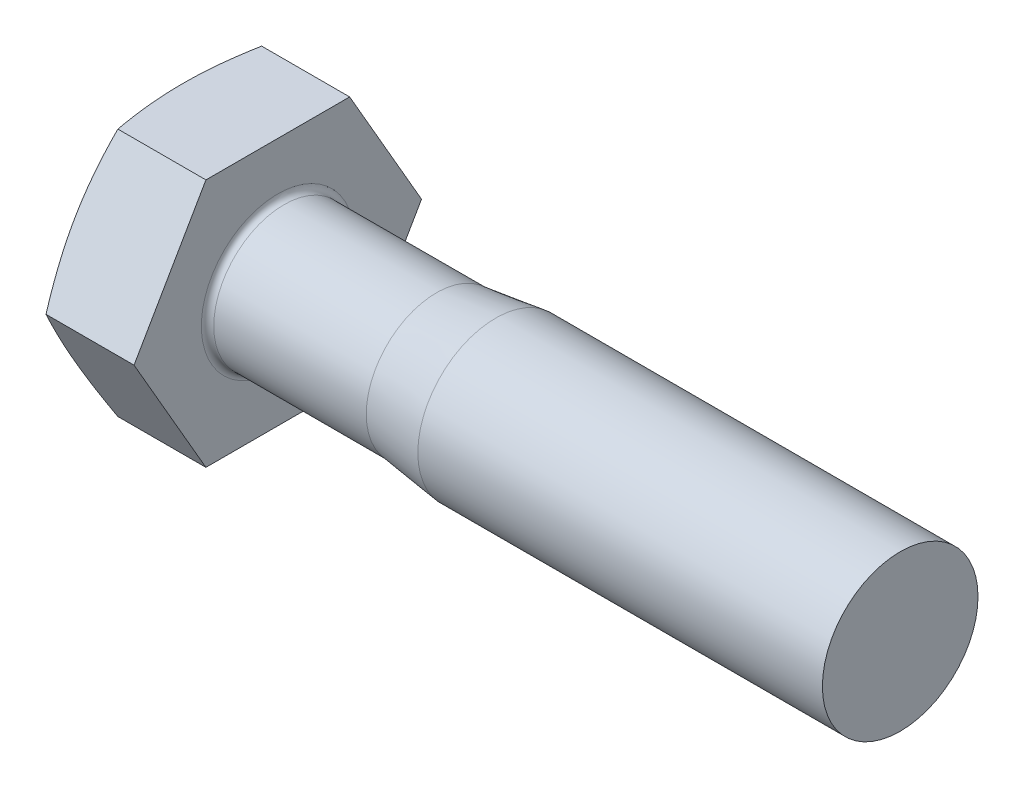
from build123d import *

# Parameters (mm, degrees)
BASEHEAD_DEPTH     = 6.4
SKETCH2_R          = 5
BASEBODY_DEPTH     = 40
SKETCH4_R          = 5.6
CUT_EXTRUDE1_DEPTH = 1.28
HEADFILLET_R       = 0.4


with BuildPart() as part:
    # Sketch1 → BaseHead (new body)
    with BuildSketch(Plane(origin=(0, 0, 0), x_dir=(0, 0, -1), z_dir=(1, 0, 0))):
        Polygon((9.237604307, 0), (4.618802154, 8), (-4.618802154, 8), (-9.237604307, 0), (-4.618802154, -8), (4.618802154, -8), align=None)
    extrude(amount=BASEHEAD_DEPTH)

    # Sketch2 → BaseBody (add)
    with BuildSketch(Plane(origin=(6.4, 0, 0), x_dir=(0, 0, -1), z_dir=(1, 0, 0))):
        Circle(SKETCH2_R)
    extrude(amount=BASEBODY_DEPTH)

    # Sketch3 → HeadChamfer (revolve, cut)
    with BuildSketch(Plane(origin=(3.161211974, 0, 2.612290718), x_dir=(0, 0, -1), z_dir=(0, 1, 0)), mode=Mode.PRIVATE) as headchamfer_sk:
        Polygon((11.849895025, 3.161211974), (11.849895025, 2.419584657), (9.812290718, 3.161211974), align=None)
    revolve(headchamfer_sk.sketch.rotate(Axis((-2.071354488, 0, 0), (1, 0, 0)), 180), axis=Axis((-2.071354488, 0, 0), (1, 0, 0)), mode=Mode.SUBTRACT)

    # Sketch4 → Cut-Extrude1 (cut)
    with BuildSketch(Plane.ZY):
        Circle(SKETCH4_R)
    extrude(amount=-CUT_EXTRUDE1_DEPTH, mode=Mode.SUBTRACT)

    # Sketch5 → Cut-Revolve1 (revolve, cut)
    with BuildSketch(Plane(origin=(-2.67963122, 0, 8.17963122), x_dir=(0, 0, -1), z_dir=(0, 1, 0)), mode=Mode.PRIVATE) as cut_revolve1_sk:
        Polygon((13.17963122, -23.07963122), (12.69263122, -19.27963122), (12.69263122, -9.07963122), (17.20563122, -9.07963122), (17.20563122, -23.07963122), align=None)
    revolve(cut_revolve1_sk.sketch.rotate(Axis((-2.697175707, 0, 0), (1, 0, 0)), 180), axis=Axis((-2.697175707, 0, 0), (1, 0, 0)), mode=Mode.SUBTRACT)

    # HeadFillet
    headfillet_edges = [part.edges().sort_by_distance(p)[0] for p in [
        (6.4, 0, -4.513),
    ]]
    fillet(headfillet_edges, radius=HEADFILLET_R)


solid = part.part
